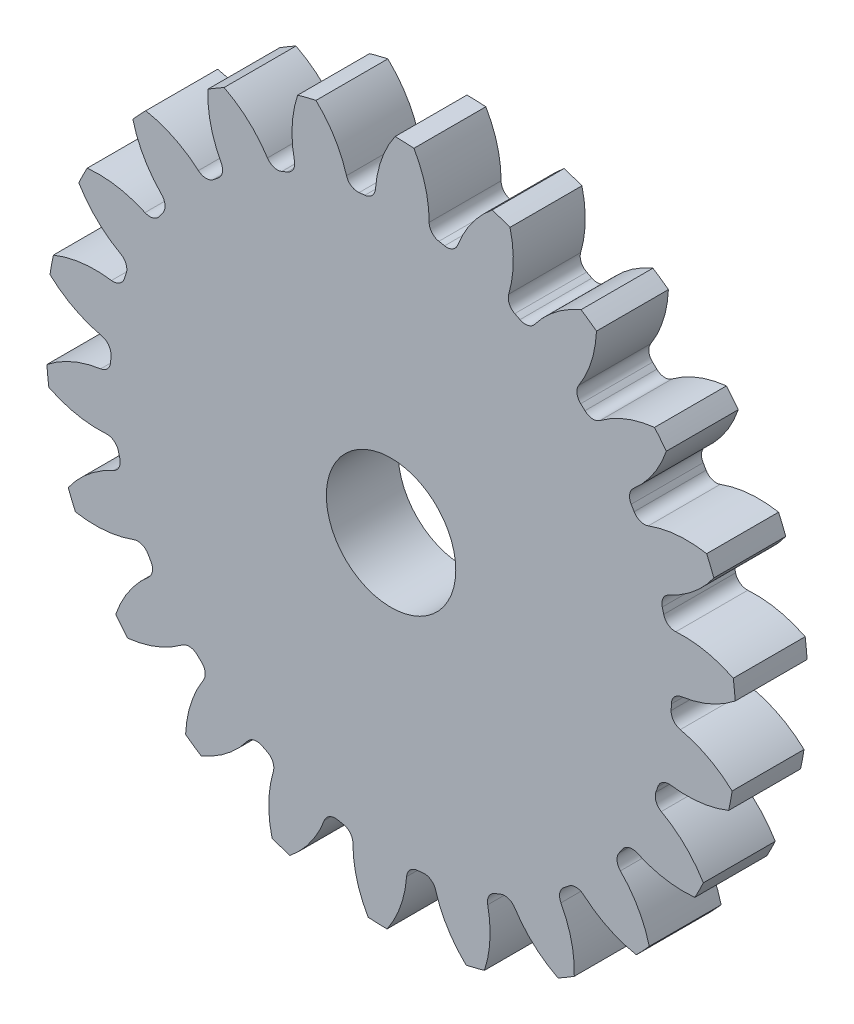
from build123d import *

# Parameters (mm, degrees)
SKETCH3_R         = 609.6
GEARBODY_DEPTH    = 127
TOOTHCUT_DEPTH    = 872.408813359
CIRPATTERN1_COUNT = 22
BOREDIA_R         = 114.3
BORE_DEPTH        = 12700


with BuildPart() as part:
    # Sketch3 → gearBody (new body)
    with BuildSketch(Plane.XY):
        Circle(SKETCH3_R)
    extrude(amount=GEARBODY_DEPTH)

    # Sketch2 → toothCut (cut, through all)
    with BuildSketch(Plane.XY):
        with BuildLine():
            ThreePointArc((494.696457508, -24.443913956), (494.923581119, -19.306445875), (495.097353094, -14.166896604))
            ThreePointArc((495.097353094, -14.166896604), (500.34601293, -0.983264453), (512.857257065, 5.711909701))
            ThreePointArc((512.857257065, 5.711909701), (564.111501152, 20.261076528), (609.6, 48.000439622))
            ThreePointArc((609.6, 48.000439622), (611.022159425, -23.835328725), (604.008362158, -95.342019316))
            ThreePointArc((604.008362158, -95.342019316), (560.818970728, -64.143425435), (510.85384716, -45.645798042))
            ThreePointArc((510.85384716, -45.645798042), (498.902171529, -37.99635124), (494.696457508, -24.443913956))
        make_face()
    toothcut = extrude(amount=TOOTHCUT_DEPTH, mode=Mode.SUBTRACT)

    # CirPattern1: toothCut ×22 about axis
    cirpattern1_axis = Axis((0, 0, 0), (0, 0, 1))
    for i in range(1, CIRPATTERN1_COUNT):
        add(toothcut.rotate(cirpattern1_axis, i * 360 / CIRPATTERN1_COUNT), mode=Mode.SUBTRACT)

    # boreDia → bore (cut, symmetric)
    with BuildSketch(Plane.XY):
        Circle(BOREDIA_R)
    extrude(amount=BORE_DEPTH, both=True, mode=Mode.SUBTRACT)


solid = part.part
